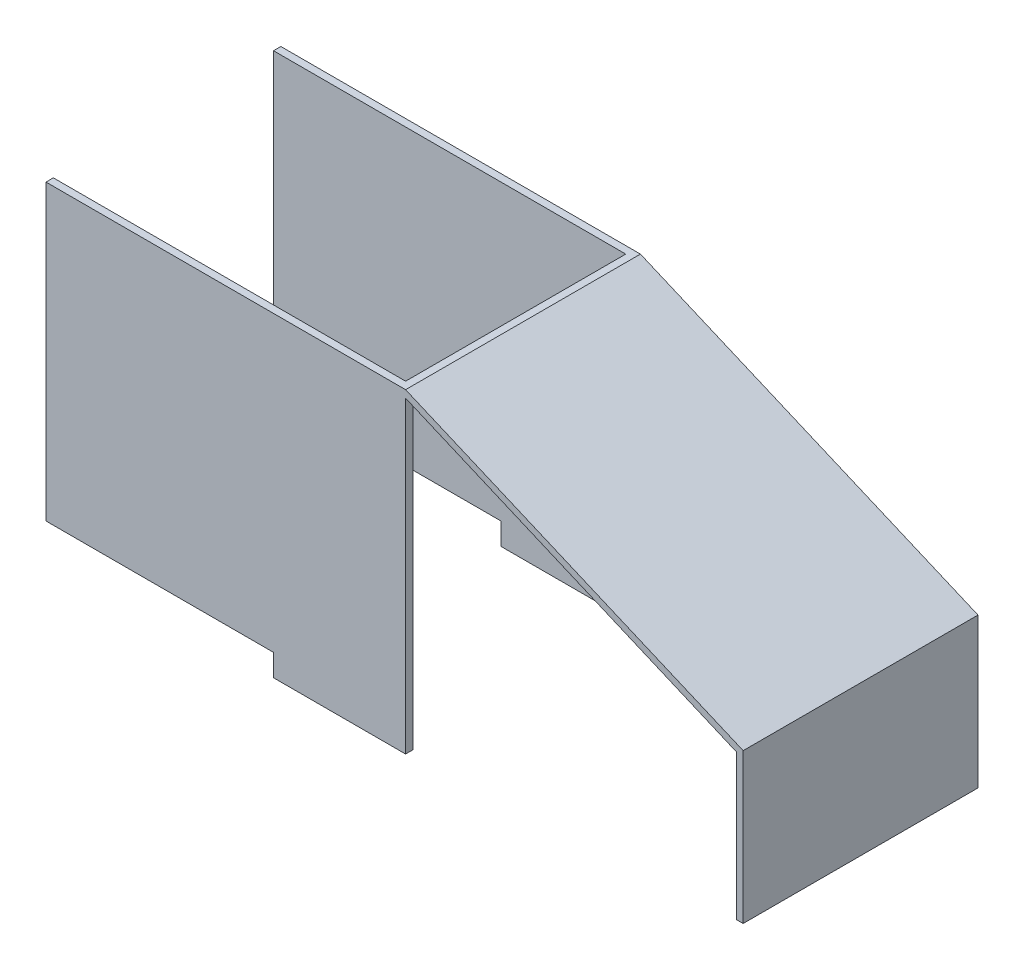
from build123d import *

# Parameters (mm, degrees)
SALIENTE_EXTRUIR1_DEPTH = 20
SALIENTE_EXTRUIR2_REACH = 30.5
CROQUIS2_W              = 9
CROQUIS2_H              = 10
CROQUIS4_W              = 24
CROQUIS4_H              = 15
CORTAR_EXTRUIR1_DEPTH   = 30
CROQUIS5_W              = 15
CROQUIS5_H              = 29.5
CORTAR_EXTRUIR2_DEPTH   = 9
SALIENTE_EXTRUIR3_REACH = 30.5
CROQUIS9_W              = 16
CROQUIS9_H              = 8.5
CORTAR_EXTRUIR3_DEPTH   = 9


with BuildPart() as part:
    # Croquis1 → Saliente-Extruir1 (new body)
    with BuildSketch(Plane(origin=(0, 0, 0), x_dir=(1, 0, 0), z_dir=(0, 1, 0))):
        Polygon((-12, 7.5), (12, 7.5), (12, -7.5), (-12, -7.5), (-12, -8), (12.5, -8), (12.5, 8), (-12, 8), align=None)
    extrude(amount=SALIENTE_EXTRUIR1_DEPTH)

    # Saliente-Extruir2: up to this face of the body (flat: up to its plane)
    saliente_extruir2_end = Plane(part.part.faces().sort_by_distance((0.25, 10, -8))[0])
    # Croquis2 → Saliente-Extruir2 (add, up to the picked face)
    with BuildSketch(Plane.XY.offset(8), mode=Mode.PRIVATE) as saliente_extruir2_sk1:
        with Locations((8, -5)):
            Rectangle(CROQUIS2_W, CROQUIS2_H)
    saliente_extruir2_tool1 = split(extrude(saliente_extruir2_sk1.sketch, amount=-SALIENTE_EXTRUIR2_REACH, mode=Mode.PRIVATE), bisect_by=saliente_extruir2_end, keep=Keep.BOTH, mode=Mode.PRIVATE)
    add(saliente_extruir2_tool1.solids().sort_by(Axis((8, -5, 8), (0, 0, -1)))[0])

    # Croquis4 → Cortar-Extruir1 (cut)
    with BuildSketch(Plane.XZ.offset(10)):
        Rectangle(CROQUIS4_W, CROQUIS4_H)
    extrude(amount=-CORTAR_EXTRUIR1_DEPTH, mode=Mode.SUBTRACT)

    # Croquis5 → Cortar-Extruir2 (cut)
    with BuildSketch(Plane(origin=(12.5, 0, 0), x_dir=(0, 0, -1), z_dir=(1, 0, 0))):
        with Locations((0, 4.75)):
            Rectangle(CROQUIS5_W, CROQUIS5_H)
    extrude(amount=-CORTAR_EXTRUIR2_DEPTH, mode=Mode.SUBTRACT)

    # Saliente-Extruir3: up to this face of the body (flat: up to its plane)
    saliente_extruir3_end = Plane(part.part.faces().sort_by_distance((1.452586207, 7.672413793, -8))[0])
    # Croquis7 → Saliente-Extruir3 (add, up to the picked face)
    with BuildSketch(Plane.XY.offset(8), mode=Mode.PRIVATE) as saliente_extruir3_sk1:
        Polygon((12.5, 20), (35.5, 10.202041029), (35.5, 0), (35.04, 0), (35.04, 9.898000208), (12.5, 19.5), align=None)
    saliente_extruir3_tool1 = split(extrude(saliente_extruir3_sk1.sketch, amount=-SALIENTE_EXTRUIR3_REACH, mode=Mode.PRIVATE), bisect_by=saliente_extruir3_end, keep=Keep.BOTH, mode=Mode.PRIVATE)
    add(saliente_extruir3_tool1.solids().sort_by(Axis((23.880545, 14.820609, 8), (0, 0, -1)))[0])

    # Croquis9 → Cortar-Extruir3 (cut)
    with BuildSketch(Plane(origin=(12.5, 0, 0), x_dir=(0, 0, -1), z_dir=(1, 0, 0))):
        with Locations((0, -5.75)):
            Rectangle(CROQUIS9_W, CROQUIS9_H)
    extrude(amount=-CORTAR_EXTRUIR3_DEPTH, mode=Mode.SUBTRACT)


solid = part.part
